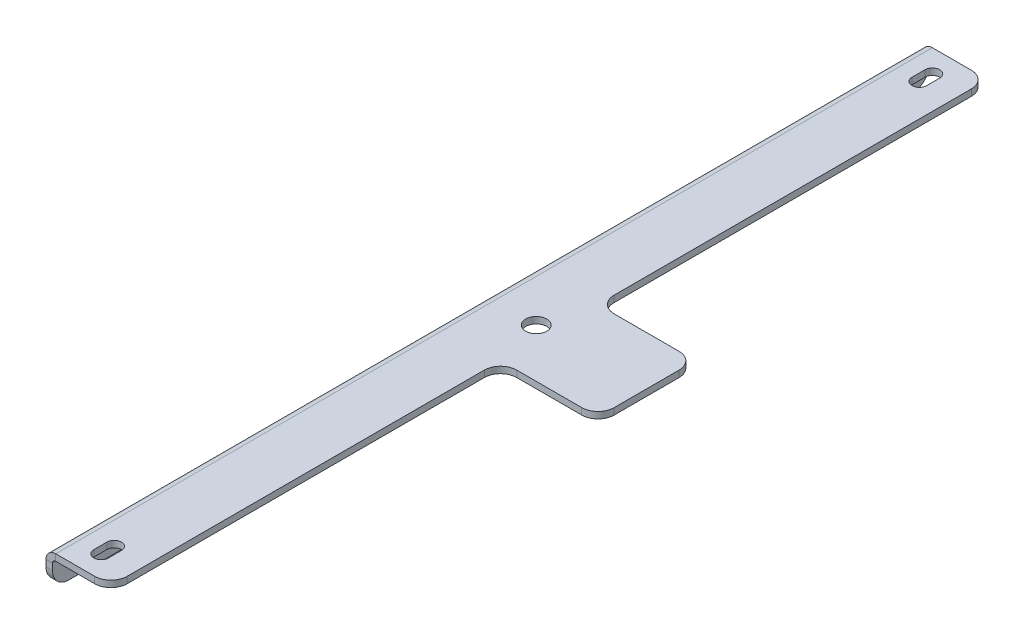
ISO-10303-21;
HEADER;
FILE_DESCRIPTION(('STEP AP214'),'2;1');
FILE_NAME('part.step','',(''),(''),'','','');
FILE_SCHEMA(('AUTOMOTIVE_DESIGN { 1 0 10303 214 1 1 1 1 }'));
ENDSEC;
DATA;
#1=APPLICATION_CONTEXT('core data for automotive mechanical design processes');
#2=APPLICATION_PROTOCOL_DEFINITION('international standard','automotive_design',2000,#1);
#3=PRODUCT_CONTEXT('',#1,'mechanical');
#4=PRODUCT('Part','Part','',(#3));
#5=PRODUCT_RELATED_PRODUCT_CATEGORY('part','',(#4));
#6=PRODUCT_DEFINITION_FORMATION('','',#4);
#7=PRODUCT_DEFINITION_CONTEXT('part definition',#1,'design');
#8=PRODUCT_DEFINITION('design','',#6,#7);
#9=PRODUCT_DEFINITION_SHAPE('','',#8);
#10=(LENGTH_UNIT() NAMED_UNIT(*) SI_UNIT(.MILLI.,.METRE.));
#11=(NAMED_UNIT(*) PLANE_ANGLE_UNIT() SI_UNIT($,.RADIAN.));
#12=(NAMED_UNIT(*) SI_UNIT($,.STERADIAN.) SOLID_ANGLE_UNIT());
#13=UNCERTAINTY_MEASURE_WITH_UNIT(LENGTH_MEASURE(1.E-05),#10,'distance_accuracy_value','');
#14=(GEOMETRIC_REPRESENTATION_CONTEXT(3) GLOBAL_UNCERTAINTY_ASSIGNED_CONTEXT((#13)) GLOBAL_UNIT_ASSIGNED_CONTEXT((#10,
#11,#12)) REPRESENTATION_CONTEXT('',''));
#15=CARTESIAN_POINT('',(0.,0.,0.));
#16=DIRECTION('',(0.,0.,1.));
#17=DIRECTION('',(1.,0.,0.));
#18=AXIS2_PLACEMENT_3D('',#15,#16,#17);
#19=CARTESIAN_POINT('',(0.,-2.,-270.));
#20=DIRECTION('',(0.,0.,-1.));
#21=DIRECTION('',(-1.,0.,0.));
#22=AXIS2_PLACEMENT_3D('',#19,#20,#21);
#23=PLANE('',#22);
#24=DIRECTION('',(-1.,0.,0.));
#25=VECTOR('',#24,1.);
#26=CARTESIAN_POINT('',(0.,0.,-270.));
#27=LINE('',#26,#25);
#28=CARTESIAN_POINT('',(15.,0.,-270.));
#29=VERTEX_POINT('',#28);
#30=CARTESIAN_POINT('',(3.,0.,-270.));
#31=VERTEX_POINT('',#30);
#32=EDGE_CURVE('E379',#29,#31,#27,.T.);
#33=ORIENTED_EDGE('',*,*,#32,.F.);
#34=DIRECTION('',(0.,1.,0.));
#35=VECTOR('',#34,1.);
#36=CARTESIAN_POINT('',(15.,-2.,-270.));
#37=LINE('',#36,#35);
#38=CARTESIAN_POINT('',(15.,-2.,-270.));
#39=VERTEX_POINT('',#38);
#40=EDGE_CURVE('E440',#29,#39,#37,.F.);
#41=ORIENTED_EDGE('',*,*,#40,.T.);
#42=DIRECTION('',(-1.,0.,0.));
#43=VECTOR('',#42,1.);
#44=CARTESIAN_POINT('',(0.,-2.,-270.));
#45=LINE('',#44,#43);
#46=CARTESIAN_POINT('',(3.,-2.,-270.));
#47=VERTEX_POINT('',#46);
#48=EDGE_CURVE('E393',#39,#47,#45,.T.);
#49=ORIENTED_EDGE('',*,*,#48,.T.);
#50=DIRECTION('',(0.,1.,0.));
#51=VECTOR('',#50,1.);
#52=CARTESIAN_POINT('',(3.,-2.,-270.));
#53=LINE('',#52,#51);
#54=EDGE_CURVE('E291',#47,#31,#53,.T.);
#55=ORIENTED_EDGE('',*,*,#54,.T.);
#56=EDGE_LOOP('',(#33,#41,#49,#55));
#57=FACE_BOUND('',#56,.T.);
#58=ADVANCED_FACE('F56',(#57),#23,.T.);
#59=CARTESIAN_POINT('',(0.,-2.,0.));
#60=DIRECTION('',(0.,-1.,0.));
#61=DIRECTION('',(0.,0.,-1.));
#62=AXIS2_PLACEMENT_3D('',#59,#60,#61);
#63=PLANE('',#62);
#64=CARTESIAN_POINT('',(16.,-2.,-135.));
#65=DIRECTION('',(0.,1.,0.));
#66=DIRECTION('',(0.,0.,1.));
#67=AXIS2_PLACEMENT_3D('',#64,#65,#66);
#68=CIRCLE('',#67,3.25000000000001);
#69=CARTESIAN_POINT('',(16.,-2.,-131.75));
#70=VERTEX_POINT('',#69);
#71=EDGE_CURVE('E305',#70,#70,#68,.T.);
#72=ORIENTED_EDGE('',*,*,#71,.T.);
#73=EDGE_LOOP('',(#72));
#74=FACE_BOUND('',#73,.T.);
#75=CARTESIAN_POINT('',(10.,-2.,-11.));
#76=DIRECTION('',(0.,1.,0.));
#77=DIRECTION('',(0.,0.,1.));
#78=AXIS2_PLACEMENT_3D('',#75,#76,#77);
#79=CIRCLE('',#78,2.25);
#80=CARTESIAN_POINT('',(12.25,-2.,-11.));
#81=VERTEX_POINT('',#80);
#82=CARTESIAN_POINT('',(7.75,-2.,-11.));
#83=VERTEX_POINT('',#82);
#84=EDGE_CURVE('E311',#81,#83,#79,.T.);
#85=ORIENTED_EDGE('',*,*,#84,.T.);
#86=DIRECTION('',(0.,0.,1.));
#87=VECTOR('',#86,1.);
#88=CARTESIAN_POINT('',(7.75,-2.,-11.));
#89=LINE('',#88,#87);
#90=CARTESIAN_POINT('',(7.75,-2.,-7.00000000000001));
#91=VERTEX_POINT('',#90);
#92=EDGE_CURVE('E314',#83,#91,#89,.T.);
#93=ORIENTED_EDGE('',*,*,#92,.T.);
#94=CARTESIAN_POINT('',(10.,-2.,-7.00000000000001));
#95=DIRECTION('',(0.,1.,0.));
#96=DIRECTION('',(0.,0.,1.));
#97=AXIS2_PLACEMENT_3D('',#94,#95,#96);
#98=CIRCLE('',#97,2.25);
#99=CARTESIAN_POINT('',(12.25,-2.,-7.00000000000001));
#100=VERTEX_POINT('',#99);
#101=EDGE_CURVE('E318',#91,#100,#98,.T.);
#102=ORIENTED_EDGE('',*,*,#101,.T.);
#103=DIRECTION('',(0.,0.,-1.));
#104=VECTOR('',#103,1.);
#105=CARTESIAN_POINT('',(12.25,-2.,-11.));
#106=LINE('',#105,#104);
#107=EDGE_CURVE('E321',#100,#81,#106,.T.);
#108=ORIENTED_EDGE('',*,*,#107,.T.);
#109=EDGE_LOOP('',(#85,#93,#102,#108));
#110=FACE_BOUND('',#109,.T.);
#111=CARTESIAN_POINT('',(9.99999999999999,-2.,-263.));
#112=DIRECTION('',(0.,1.,0.));
#113=DIRECTION('',(0.,0.,1.));
#114=AXIS2_PLACEMENT_3D('',#111,#112,#113);
#115=CIRCLE('',#114,2.24999999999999);
#116=CARTESIAN_POINT('',(12.25,-2.,-263.));
#117=VERTEX_POINT('',#116);
#118=CARTESIAN_POINT('',(7.75000000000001,-2.,-263.));
#119=VERTEX_POINT('',#118);
#120=EDGE_CURVE('E343',#117,#119,#115,.T.);
#121=ORIENTED_EDGE('',*,*,#120,.T.);
#122=DIRECTION('',(0.,0.,1.));
#123=VECTOR('',#122,1.);
#124=CARTESIAN_POINT('',(7.75000000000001,-2.,-263.));
#125=LINE('',#124,#123);
#126=CARTESIAN_POINT('',(7.75000000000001,-2.,-259.));
#127=VERTEX_POINT('',#126);
#128=EDGE_CURVE('E346',#119,#127,#125,.T.);
#129=ORIENTED_EDGE('',*,*,#128,.T.);
#130=CARTESIAN_POINT('',(9.99999999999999,-2.,-259.));
#131=DIRECTION('',(0.,1.,0.));
#132=DIRECTION('',(0.,0.,1.));
#133=AXIS2_PLACEMENT_3D('',#130,#131,#132);
#134=CIRCLE('',#133,2.24999999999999);
#135=CARTESIAN_POINT('',(12.25,-2.,-259.));
#136=VERTEX_POINT('',#135);
#137=EDGE_CURVE('E350',#127,#136,#134,.T.);
#138=ORIENTED_EDGE('',*,*,#137,.T.);
#139=DIRECTION('',(0.,0.,-1.));
#140=VECTOR('',#139,1.);
#141=CARTESIAN_POINT('',(12.25,-2.,-263.));
#142=LINE('',#141,#140);
#143=EDGE_CURVE('E353',#136,#117,#142,.T.);
#144=ORIENTED_EDGE('',*,*,#143,.T.);
#145=EDGE_LOOP('',(#121,#129,#138,#144));
#146=FACE_BOUND('',#145,.T.);
#147=ORIENTED_EDGE('',*,*,#48,.F.);
#148=CARTESIAN_POINT('',(15.,-2.,-265.));
#149=DIRECTION('',(0.,-1.,0.));
#150=DIRECTION('',(0.,0.,-1.));
#151=AXIS2_PLACEMENT_3D('',#148,#149,#150);
#152=CIRCLE('',#151,5.);
#153=CARTESIAN_POINT('',(20.,-2.,-265.));
#154=VERTEX_POINT('',#153);
#155=EDGE_CURVE('E448',#39,#154,#152,.T.);
#156=ORIENTED_EDGE('',*,*,#155,.T.);
#157=DIRECTION('',(0.,0.,-1.));
#158=VECTOR('',#157,1.);
#159=CARTESIAN_POINT('',(20.,-2.,-150.));
#160=LINE('',#159,#158);
#161=CARTESIAN_POINT('',(20.,-2.,-155.));
#162=VERTEX_POINT('',#161);
#163=EDGE_CURVE('E390',#162,#154,#160,.T.);
#164=ORIENTED_EDGE('',*,*,#163,.F.);
#165=CARTESIAN_POINT('',(25.,-2.,-155.));
#166=DIRECTION('',(0.,-1.,0.));
#167=DIRECTION('',(0.,0.,-1.));
#168=AXIS2_PLACEMENT_3D('',#165,#166,#167);
#169=CIRCLE('',#168,5.);
#170=CARTESIAN_POINT('',(25.,-2.,-150.));
#171=VERTEX_POINT('',#170);
#172=EDGE_CURVE('E477',#162,#171,#169,.F.);
#173=ORIENTED_EDGE('',*,*,#172,.T.);
#174=DIRECTION('',(-1.,0.,0.));
#175=VECTOR('',#174,1.);
#176=CARTESIAN_POINT('',(20.,-2.,-150.));
#177=LINE('',#176,#175);
#178=CARTESIAN_POINT('',(45.,-2.,-150.));
#179=VERTEX_POINT('',#178);
#180=EDGE_CURVE('E387',#179,#171,#177,.T.);
#181=ORIENTED_EDGE('',*,*,#180,.F.);
#182=CARTESIAN_POINT('',(45.,-2.,-145.));
#183=DIRECTION('',(0.,-1.,0.));
#184=DIRECTION('',(0.,0.,-1.));
#185=AXIS2_PLACEMENT_3D('',#182,#183,#184);
#186=CIRCLE('',#185,5.);
#187=CARTESIAN_POINT('',(50.,-2.,-145.));
#188=VERTEX_POINT('',#187);
#189=EDGE_CURVE('E446',#179,#188,#186,.T.);
#190=ORIENTED_EDGE('',*,*,#189,.T.);
#191=DIRECTION('',(0.,0.,-1.));
#192=VECTOR('',#191,1.);
#193=CARTESIAN_POINT('',(50.,-2.,-150.));
#194=LINE('',#193,#192);
#195=CARTESIAN_POINT('',(50.,-2.,-125.));
#196=VERTEX_POINT('',#195);
#197=EDGE_CURVE('E384',#196,#188,#194,.T.);
#198=ORIENTED_EDGE('',*,*,#197,.F.);
#199=CARTESIAN_POINT('',(45.,-2.,-125.));
#200=DIRECTION('',(0.,-1.,0.));
#201=DIRECTION('',(0.,0.,-1.));
#202=AXIS2_PLACEMENT_3D('',#199,#200,#201);
#203=CIRCLE('',#202,5.);
#204=CARTESIAN_POINT('',(45.,-2.,-120.));
#205=VERTEX_POINT('',#204);
#206=EDGE_CURVE('E444',#196,#205,#203,.T.);
#207=ORIENTED_EDGE('',*,*,#206,.T.);
#208=DIRECTION('',(1.,0.,0.));
#209=VECTOR('',#208,1.);
#210=CARTESIAN_POINT('',(20.,-2.,-120.));
#211=LINE('',#210,#209);
#212=CARTESIAN_POINT('',(25.,-2.,-120.));
#213=VERTEX_POINT('',#212);
#214=EDGE_CURVE('E381',#213,#205,#211,.T.);
#215=ORIENTED_EDGE('',*,*,#214,.F.);
#216=CARTESIAN_POINT('',(25.,-2.,-115.));
#217=DIRECTION('',(0.,-1.,0.));
#218=DIRECTION('',(0.,0.,-1.));
#219=AXIS2_PLACEMENT_3D('',#216,#217,#218);
#220=CIRCLE('',#219,5.);
#221=CARTESIAN_POINT('',(20.,-2.,-115.));
#222=VERTEX_POINT('',#221);
#223=EDGE_CURVE('E13',#213,#222,#220,.F.);
#224=ORIENTED_EDGE('',*,*,#223,.T.);
#225=DIRECTION('',(0.,0.,-1.));
#226=VECTOR('',#225,1.);
#227=CARTESIAN_POINT('',(20.,-2.,0.));
#228=LINE('',#227,#226);
#229=CARTESIAN_POINT('',(20.,-2.,-5.));
#230=VERTEX_POINT('',#229);
#231=EDGE_CURVE('E378',#230,#222,#228,.T.);
#232=ORIENTED_EDGE('',*,*,#231,.F.);
#233=CARTESIAN_POINT('',(15.,-2.,-5.));
#234=DIRECTION('',(0.,-1.,0.));
#235=DIRECTION('',(0.,0.,-1.));
#236=AXIS2_PLACEMENT_3D('',#233,#234,#235);
#237=CIRCLE('',#236,5.);
#238=CARTESIAN_POINT('',(15.,-2.,0.));
#239=VERTEX_POINT('',#238);
#240=EDGE_CURVE('E442',#230,#239,#237,.T.);
#241=ORIENTED_EDGE('',*,*,#240,.T.);
#242=DIRECTION('',(1.,0.,0.));
#243=VECTOR('',#242,1.);
#244=CARTESIAN_POINT('',(0.,-2.,0.));
#245=LINE('',#244,#243);
#246=CARTESIAN_POINT('',(3.,-2.,0.));
#247=VERTEX_POINT('',#246);
#248=EDGE_CURVE('E375',#247,#239,#245,.T.);
#249=ORIENTED_EDGE('',*,*,#248,.F.);
#250=DIRECTION('',(0.,0.,-1.));
#251=VECTOR('',#250,1.);
#252=CARTESIAN_POINT('',(3.,-2.,-270.));
#253=LINE('',#252,#251);
#254=EDGE_CURVE('E295',#47,#247,#253,.F.);
#255=ORIENTED_EDGE('',*,*,#254,.F.);
#256=EDGE_LOOP('',(#147,#156,#164,#173,#181,#190,#198,#207,#215,#224,#232,#241,#249,#255));
#257=FACE_BOUND('',#256,.T.);
#258=ADVANCED_FACE('F491',(#74,#110,#146,#257),#63,.T.);
#259=CARTESIAN_POINT('',(0.,0.,0.));
#260=DIRECTION('',(0.,-1.,0.));
#261=DIRECTION('',(0.,0.,-1.));
#262=AXIS2_PLACEMENT_3D('',#259,#260,#261);
#263=PLANE('',#262);
#264=DIRECTION('',(0.,0.,1.));
#265=VECTOR('',#264,1.);
#266=CARTESIAN_POINT('',(7.75000000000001,0.,-263.));
#267=LINE('',#266,#265);
#268=CARTESIAN_POINT('',(7.75000000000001,0.,-263.));
#269=VERTEX_POINT('',#268);
#270=CARTESIAN_POINT('',(7.75,0.,-259.));
#271=VERTEX_POINT('',#270);
#272=EDGE_CURVE('E358',#269,#271,#267,.T.);
#273=ORIENTED_EDGE('',*,*,#272,.F.);
#274=CARTESIAN_POINT('',(9.99999999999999,0.,-263.));
#275=DIRECTION('',(0.,1.,0.));
#276=DIRECTION('',(0.,0.,1.));
#277=AXIS2_PLACEMENT_3D('',#274,#275,#276);
#278=CIRCLE('',#277,2.24999999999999);
#279=CARTESIAN_POINT('',(12.25,0.,-263.));
#280=VERTEX_POINT('',#279);
#281=EDGE_CURVE('E336',#280,#269,#278,.T.);
#282=ORIENTED_EDGE('',*,*,#281,.F.);
#283=DIRECTION('',(0.,0.,-1.));
#284=VECTOR('',#283,1.);
#285=CARTESIAN_POINT('',(12.25,0.,-263.));
#286=LINE('',#285,#284);
#287=CARTESIAN_POINT('',(12.25,0.,-259.));
#288=VERTEX_POINT('',#287);
#289=EDGE_CURVE('E347',#288,#280,#286,.T.);
#290=ORIENTED_EDGE('',*,*,#289,.F.);
#291=CARTESIAN_POINT('',(9.99999999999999,0.,-259.));
#292=DIRECTION('',(0.,1.,0.));
#293=DIRECTION('',(0.,0.,1.));
#294=AXIS2_PLACEMENT_3D('',#291,#292,#293);
#295=CIRCLE('',#294,2.24999999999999);
#296=EDGE_CURVE('E361',#271,#288,#295,.T.);
#297=ORIENTED_EDGE('',*,*,#296,.F.);
#298=EDGE_LOOP('',(#273,#282,#290,#297));
#299=FACE_BOUND('',#298,.T.);
#300=DIRECTION('',(0.,0.,1.));
#301=VECTOR('',#300,1.);
#302=CARTESIAN_POINT('',(7.75,0.,-11.));
#303=LINE('',#302,#301);
#304=CARTESIAN_POINT('',(7.75,0.,-11.));
#305=VERTEX_POINT('',#304);
#306=CARTESIAN_POINT('',(7.75,0.,-7.00000000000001));
#307=VERTEX_POINT('',#306);
#308=EDGE_CURVE('E326',#305,#307,#303,.T.);
#309=ORIENTED_EDGE('',*,*,#308,.F.);
#310=CARTESIAN_POINT('',(10.,0.,-11.));
#311=DIRECTION('',(0.,1.,0.));
#312=DIRECTION('',(0.,0.,1.));
#313=AXIS2_PLACEMENT_3D('',#310,#311,#312);
#314=CIRCLE('',#313,2.25);
#315=CARTESIAN_POINT('',(12.25,0.,-11.));
#316=VERTEX_POINT('',#315);
#317=EDGE_CURVE('E308',#316,#305,#314,.T.);
#318=ORIENTED_EDGE('',*,*,#317,.F.);
#319=DIRECTION('',(0.,0.,-1.));
#320=VECTOR('',#319,1.);
#321=CARTESIAN_POINT('',(12.25,0.,-11.));
#322=LINE('',#321,#320);
#323=CARTESIAN_POINT('',(12.25,0.,-7.00000000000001));
#324=VERTEX_POINT('',#323);
#325=EDGE_CURVE('E315',#324,#316,#322,.T.);
#326=ORIENTED_EDGE('',*,*,#325,.F.);
#327=CARTESIAN_POINT('',(10.,0.,-7.00000000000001));
#328=DIRECTION('',(0.,1.,0.));
#329=DIRECTION('',(0.,0.,1.));
#330=AXIS2_PLACEMENT_3D('',#327,#328,#329);
#331=CIRCLE('',#330,2.25);
#332=EDGE_CURVE('E329',#307,#324,#331,.T.);
#333=ORIENTED_EDGE('',*,*,#332,.F.);
#334=EDGE_LOOP('',(#309,#318,#326,#333));
#335=FACE_BOUND('',#334,.T.);
#336=CARTESIAN_POINT('',(16.,0.,-135.));
#337=DIRECTION('',(0.,1.,0.));
#338=DIRECTION('',(0.,0.,1.));
#339=AXIS2_PLACEMENT_3D('',#336,#337,#338);
#340=CIRCLE('',#339,3.25000000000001);
#341=CARTESIAN_POINT('',(16.,0.,-131.75));
#342=VERTEX_POINT('',#341);
#343=EDGE_CURVE('E302',#342,#342,#340,.T.);
#344=ORIENTED_EDGE('',*,*,#343,.F.);
#345=EDGE_LOOP('',(#344));
#346=FACE_BOUND('',#345,.T.);
#347=DIRECTION('',(0.,0.,-1.));
#348=VECTOR('',#347,1.);
#349=CARTESIAN_POINT('',(20.,0.,-150.));
#350=LINE('',#349,#348);
#351=CARTESIAN_POINT('',(20.,0.,-155.));
#352=VERTEX_POINT('',#351);
#353=CARTESIAN_POINT('',(20.,0.,-265.));
#354=VERTEX_POINT('',#353);
#355=EDGE_CURVE('E410',#352,#354,#350,.T.);
#356=ORIENTED_EDGE('',*,*,#355,.T.);
#357=CARTESIAN_POINT('',(15.,0.,-265.));
#358=DIRECTION('',(0.,-1.,0.));
#359=DIRECTION('',(0.,0.,-1.));
#360=AXIS2_PLACEMENT_3D('',#357,#358,#359);
#361=CIRCLE('',#360,5.);
#362=EDGE_CURVE('E438',#354,#29,#361,.F.);
#363=ORIENTED_EDGE('',*,*,#362,.T.);
#364=ORIENTED_EDGE('',*,*,#32,.T.);
#365=DIRECTION('',(0.,0.,-1.));
#366=VECTOR('',#365,1.);
#367=CARTESIAN_POINT('',(3.,0.,-270.));
#368=LINE('',#367,#366);
#369=CARTESIAN_POINT('',(3.,0.,0.));
#370=VERTEX_POINT('',#369);
#371=EDGE_CURVE('E263',#31,#370,#368,.F.);
#372=ORIENTED_EDGE('',*,*,#371,.T.);
#373=DIRECTION('',(1.,0.,0.));
#374=VECTOR('',#373,1.);
#375=CARTESIAN_POINT('',(0.,0.,0.));
#376=LINE('',#375,#374);
#377=CARTESIAN_POINT('',(15.,0.,0.));
#378=VERTEX_POINT('',#377);
#379=EDGE_CURVE('E368',#370,#378,#376,.T.);
#380=ORIENTED_EDGE('',*,*,#379,.T.);
#381=CARTESIAN_POINT('',(15.,0.,-5.));
#382=DIRECTION('',(0.,-1.,0.));
#383=DIRECTION('',(0.,0.,-1.));
#384=AXIS2_PLACEMENT_3D('',#381,#382,#383);
#385=CIRCLE('',#384,5.);
#386=CARTESIAN_POINT('',(20.,0.,-5.));
#387=VERTEX_POINT('',#386);
#388=EDGE_CURVE('E432',#378,#387,#385,.F.);
#389=ORIENTED_EDGE('',*,*,#388,.T.);
#390=DIRECTION('',(0.,0.,-1.));
#391=VECTOR('',#390,1.);
#392=CARTESIAN_POINT('',(20.,0.,0.));
#393=LINE('',#392,#391);
#394=CARTESIAN_POINT('',(20.,0.,-115.));
#395=VERTEX_POINT('',#394);
#396=EDGE_CURVE('E398',#387,#395,#393,.T.);
#397=ORIENTED_EDGE('',*,*,#396,.T.);
#398=CARTESIAN_POINT('',(25.,0.,-115.));
#399=DIRECTION('',(0.,-1.,0.));
#400=DIRECTION('',(0.,0.,-1.));
#401=AXIS2_PLACEMENT_3D('',#398,#399,#400);
#402=CIRCLE('',#401,5.);
#403=CARTESIAN_POINT('',(25.,0.,-120.));
#404=VERTEX_POINT('',#403);
#405=EDGE_CURVE('E64',#395,#404,#402,.T.);
#406=ORIENTED_EDGE('',*,*,#405,.T.);
#407=DIRECTION('',(1.,0.,0.));
#408=VECTOR('',#407,1.);
#409=CARTESIAN_POINT('',(20.,0.,-120.));
#410=LINE('',#409,#408);
#411=CARTESIAN_POINT('',(45.,0.,-120.));
#412=VERTEX_POINT('',#411);
#413=EDGE_CURVE('E401',#404,#412,#410,.T.);
#414=ORIENTED_EDGE('',*,*,#413,.T.);
#415=CARTESIAN_POINT('',(45.,0.,-125.));
#416=DIRECTION('',(0.,-1.,0.));
#417=DIRECTION('',(0.,0.,-1.));
#418=AXIS2_PLACEMENT_3D('',#415,#416,#417);
#419=CIRCLE('',#418,5.);
#420=CARTESIAN_POINT('',(50.,0.,-125.));
#421=VERTEX_POINT('',#420);
#422=EDGE_CURVE('E434',#412,#421,#419,.F.);
#423=ORIENTED_EDGE('',*,*,#422,.T.);
#424=DIRECTION('',(0.,0.,-1.));
#425=VECTOR('',#424,1.);
#426=CARTESIAN_POINT('',(50.,0.,-150.));
#427=LINE('',#426,#425);
#428=CARTESIAN_POINT('',(50.,0.,-145.));
#429=VERTEX_POINT('',#428);
#430=EDGE_CURVE('E404',#421,#429,#427,.T.);
#431=ORIENTED_EDGE('',*,*,#430,.T.);
#432=CARTESIAN_POINT('',(45.,0.,-145.));
#433=DIRECTION('',(0.,-1.,0.));
#434=DIRECTION('',(0.,0.,-1.));
#435=AXIS2_PLACEMENT_3D('',#432,#433,#434);
#436=CIRCLE('',#435,5.);
#437=CARTESIAN_POINT('',(45.,0.,-150.));
#438=VERTEX_POINT('',#437);
#439=EDGE_CURVE('E436',#429,#438,#436,.F.);
#440=ORIENTED_EDGE('',*,*,#439,.T.);
#441=DIRECTION('',(-1.,0.,0.));
#442=VECTOR('',#441,1.);
#443=CARTESIAN_POINT('',(20.,0.,-150.));
#444=LINE('',#443,#442);
#445=CARTESIAN_POINT('',(25.,0.,-150.));
#446=VERTEX_POINT('',#445);
#447=EDGE_CURVE('E407',#438,#446,#444,.T.);
#448=ORIENTED_EDGE('',*,*,#447,.T.);
#449=CARTESIAN_POINT('',(25.,0.,-155.));
#450=DIRECTION('',(0.,-1.,0.));
#451=DIRECTION('',(0.,0.,-1.));
#452=AXIS2_PLACEMENT_3D('',#449,#450,#451);
#453=CIRCLE('',#452,5.);
#454=EDGE_CURVE('E475',#446,#352,#453,.T.);
#455=ORIENTED_EDGE('',*,*,#454,.T.);
#456=EDGE_LOOP('',(#356,#363,#364,#372,#380,#389,#397,#406,#414,#423,#431,#440,#448,#455));
#457=FACE_BOUND('',#456,.T.);
#458=ADVANCED_FACE('F480',(#299,#335,#346,#457),#263,.F.);
#459=CARTESIAN_POINT('',(20.,-2.,-150.));
#460=DIRECTION('',(1.,0.,0.));
#461=DIRECTION('',(0.,0.,-1.));
#462=AXIS2_PLACEMENT_3D('',#459,#460,#461);
#463=PLANE('',#462);
#464=ORIENTED_EDGE('',*,*,#163,.T.);
#465=DIRECTION('',(0.,1.,0.));
#466=VECTOR('',#465,1.);
#467=CARTESIAN_POINT('',(20.,-2.,-265.));
#468=LINE('',#467,#466);
#469=EDGE_CURVE('E429',#154,#354,#468,.T.);
#470=ORIENTED_EDGE('',*,*,#469,.T.);
#471=ORIENTED_EDGE('',*,*,#355,.F.);
#472=DIRECTION('',(0.,1.,0.));
#473=VECTOR('',#472,1.);
#474=CARTESIAN_POINT('',(20.,-2.,-155.));
#475=LINE('',#474,#473);
#476=EDGE_CURVE('E427',#352,#162,#475,.F.);
#477=ORIENTED_EDGE('',*,*,#476,.T.);
#478=EDGE_LOOP('',(#464,#470,#471,#477));
#479=FACE_BOUND('',#478,.T.);
#480=ADVANCED_FACE('F550',(#479),#463,.T.);
#481=CARTESIAN_POINT('',(20.,-2.,-150.));
#482=DIRECTION('',(0.,0.,-1.));
#483=DIRECTION('',(-1.,0.,0.));
#484=AXIS2_PLACEMENT_3D('',#481,#482,#483);
#485=PLANE('',#484);
#486=ORIENTED_EDGE('',*,*,#180,.T.);
#487=DIRECTION('',(0.,1.,0.));
#488=VECTOR('',#487,1.);
#489=CARTESIAN_POINT('',(25.,0.,-150.));
#490=LINE('',#489,#488);
#491=EDGE_CURVE('E452',#171,#446,#490,.T.);
#492=ORIENTED_EDGE('',*,*,#491,.T.);
#493=ORIENTED_EDGE('',*,*,#447,.F.);
#494=DIRECTION('',(0.,1.,0.));
#495=VECTOR('',#494,1.);
#496=CARTESIAN_POINT('',(45.,-2.,-150.));
#497=LINE('',#496,#495);
#498=EDGE_CURVE('E450',#438,#179,#497,.F.);
#499=ORIENTED_EDGE('',*,*,#498,.T.);
#500=EDGE_LOOP('',(#486,#492,#493,#499));
#501=FACE_BOUND('',#500,.T.);
#502=ADVANCED_FACE('F553',(#501),#485,.T.);
#503=CARTESIAN_POINT('',(50.,-2.,-150.));
#504=DIRECTION('',(1.,0.,0.));
#505=DIRECTION('',(0.,0.,-1.));
#506=AXIS2_PLACEMENT_3D('',#503,#504,#505);
#507=PLANE('',#506);
#508=ORIENTED_EDGE('',*,*,#197,.T.);
#509=DIRECTION('',(0.,1.,0.));
#510=VECTOR('',#509,1.);
#511=CARTESIAN_POINT('',(50.,-2.,-145.));
#512=LINE('',#511,#510);
#513=EDGE_CURVE('E457',#188,#429,#512,.T.);
#514=ORIENTED_EDGE('',*,*,#513,.T.);
#515=ORIENTED_EDGE('',*,*,#430,.F.);
#516=DIRECTION('',(0.,1.,0.));
#517=VECTOR('',#516,1.);
#518=CARTESIAN_POINT('',(50.,-2.,-125.));
#519=LINE('',#518,#517);
#520=EDGE_CURVE('E455',#421,#196,#519,.F.);
#521=ORIENTED_EDGE('',*,*,#520,.T.);
#522=EDGE_LOOP('',(#508,#514,#515,#521));
#523=FACE_BOUND('',#522,.T.);
#524=ADVANCED_FACE('F557',(#523),#507,.T.);
#525=CARTESIAN_POINT('',(20.,-2.,-120.));
#526=DIRECTION('',(0.,0.,1.));
#527=DIRECTION('',(1.,0.,0.));
#528=AXIS2_PLACEMENT_3D('',#525,#526,#527);
#529=PLANE('',#528);
#530=ORIENTED_EDGE('',*,*,#214,.T.);
#531=DIRECTION('',(0.,1.,0.));
#532=VECTOR('',#531,1.);
#533=CARTESIAN_POINT('',(45.,-2.,-120.));
#534=LINE('',#533,#532);
#535=EDGE_CURVE('E462',#205,#412,#534,.T.);
#536=ORIENTED_EDGE('',*,*,#535,.T.);
#537=ORIENTED_EDGE('',*,*,#413,.F.);
#538=DIRECTION('',(0.,1.,0.));
#539=VECTOR('',#538,1.);
#540=CARTESIAN_POINT('',(25.,-2.,-120.));
#541=LINE('',#540,#539);
#542=EDGE_CURVE('E460',#404,#213,#541,.F.);
#543=ORIENTED_EDGE('',*,*,#542,.T.);
#544=EDGE_LOOP('',(#530,#536,#537,#543));
#545=FACE_BOUND('',#544,.T.);
#546=ADVANCED_FACE('F485',(#545),#529,.T.);
#547=CARTESIAN_POINT('',(20.,-2.,0.));
#548=DIRECTION('',(1.,0.,0.));
#549=DIRECTION('',(0.,0.,-1.));
#550=AXIS2_PLACEMENT_3D('',#547,#548,#549);
#551=PLANE('',#550);
#552=ORIENTED_EDGE('',*,*,#231,.T.);
#553=DIRECTION('',(0.,1.,0.));
#554=VECTOR('',#553,1.);
#555=CARTESIAN_POINT('',(20.,0.,-115.));
#556=LINE('',#555,#554);
#557=EDGE_CURVE('E466',#222,#395,#556,.T.);
#558=ORIENTED_EDGE('',*,*,#557,.T.);
#559=ORIENTED_EDGE('',*,*,#396,.F.);
#560=DIRECTION('',(0.,1.,0.));
#561=VECTOR('',#560,1.);
#562=CARTESIAN_POINT('',(20.,-2.,-5.));
#563=LINE('',#562,#561);
#564=EDGE_CURVE('E76',#387,#230,#563,.F.);
#565=ORIENTED_EDGE('',*,*,#564,.T.);
#566=EDGE_LOOP('',(#552,#558,#559,#565));
#567=FACE_BOUND('',#566,.T.);
#568=ADVANCED_FACE('F488',(#567),#551,.T.);
#569=CARTESIAN_POINT('',(0.,-2.,0.));
#570=DIRECTION('',(0.,0.,1.));
#571=DIRECTION('',(1.,0.,0.));
#572=AXIS2_PLACEMENT_3D('',#569,#570,#571);
#573=PLANE('',#572);
#574=ORIENTED_EDGE('',*,*,#248,.T.);
#575=DIRECTION('',(0.,1.,0.));
#576=VECTOR('',#575,1.);
#577=CARTESIAN_POINT('',(15.,-2.,0.));
#578=LINE('',#577,#576);
#579=EDGE_CURVE('E469',#239,#378,#578,.T.);
#580=ORIENTED_EDGE('',*,*,#579,.T.);
#581=ORIENTED_EDGE('',*,*,#379,.F.);
#582=DIRECTION('',(0.,1.,0.));
#583=VECTOR('',#582,1.);
#584=CARTESIAN_POINT('',(3.,-2.,0.));
#585=LINE('',#584,#583);
#586=EDGE_CURVE('E299',#247,#370,#585,.T.);
#587=ORIENTED_EDGE('',*,*,#586,.F.);
#588=EDGE_LOOP('',(#574,#580,#581,#587));
#589=FACE_BOUND('',#588,.T.);
#590=ADVANCED_FACE('F498',(#589),#573,.T.);
#591=CARTESIAN_POINT('',(9.99999999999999,-2.,-263.));
#592=DIRECTION('',(0.,1.,0.));
#593=DIRECTION('',(0.,0.,1.));
#594=AXIS2_PLACEMENT_3D('',#591,#592,#593);
#595=CYLINDRICAL_SURFACE('',#594,2.24999999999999);
#596=ORIENTED_EDGE('',*,*,#281,.T.);
#597=DIRECTION('',(0.,1.,0.));
#598=VECTOR('',#597,1.);
#599=CARTESIAN_POINT('',(7.75000000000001,-2.,-263.));
#600=LINE('',#599,#598);
#601=EDGE_CURVE('E356',#119,#269,#600,.T.);
#602=ORIENTED_EDGE('',*,*,#601,.F.);
#603=ORIENTED_EDGE('',*,*,#120,.F.);
#604=DIRECTION('',(0.,1.,0.));
#605=VECTOR('',#604,1.);
#606=CARTESIAN_POINT('',(12.25,-2.,-263.));
#607=LINE('',#606,#605);
#608=EDGE_CURVE('E366',#117,#280,#607,.T.);
#609=ORIENTED_EDGE('',*,*,#608,.T.);
#610=EDGE_LOOP('',(#596,#602,#603,#609));
#611=FACE_BOUND('',#610,.T.);
#612=ADVANCED_FACE('F566',(#611),#595,.F.);
#613=CARTESIAN_POINT('',(12.25,-2.,-263.));
#614=DIRECTION('',(1.,0.,0.));
#615=DIRECTION('',(0.,0.,-1.));
#616=AXIS2_PLACEMENT_3D('',#613,#614,#615);
#617=PLANE('',#616);
#618=ORIENTED_EDGE('',*,*,#289,.T.);
#619=ORIENTED_EDGE('',*,*,#608,.F.);
#620=ORIENTED_EDGE('',*,*,#143,.F.);
#621=DIRECTION('',(0.,1.,0.));
#622=VECTOR('',#621,1.);
#623=CARTESIAN_POINT('',(12.25,-2.,-259.));
#624=LINE('',#623,#622);
#625=EDGE_CURVE('E369',#136,#288,#624,.T.);
#626=ORIENTED_EDGE('',*,*,#625,.T.);
#627=EDGE_LOOP('',(#618,#619,#620,#626));
#628=FACE_BOUND('',#627,.T.);
#629=ADVANCED_FACE('F570',(#628),#617,.F.);
#630=CARTESIAN_POINT('',(9.99999999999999,-2.,-259.));
#631=DIRECTION('',(0.,1.,0.));
#632=DIRECTION('',(0.,0.,1.));
#633=AXIS2_PLACEMENT_3D('',#630,#631,#632);
#634=CYLINDRICAL_SURFACE('',#633,2.24999999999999);
#635=ORIENTED_EDGE('',*,*,#296,.T.);
#636=ORIENTED_EDGE('',*,*,#625,.F.);
#637=ORIENTED_EDGE('',*,*,#137,.F.);
#638=DIRECTION('',(0.,1.,0.));
#639=VECTOR('',#638,1.);
#640=CARTESIAN_POINT('',(7.75,-2.,-259.));
#641=LINE('',#640,#639);
#642=EDGE_CURVE('E371',#127,#271,#641,.T.);
#643=ORIENTED_EDGE('',*,*,#642,.T.);
#644=EDGE_LOOP('',(#635,#636,#637,#643));
#645=FACE_BOUND('',#644,.T.);
#646=ADVANCED_FACE('F576',(#645),#634,.F.);
#647=CARTESIAN_POINT('',(7.75000000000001,-2.,-263.));
#648=DIRECTION('',(-1.,0.,0.));
#649=DIRECTION('',(0.,0.,1.));
#650=AXIS2_PLACEMENT_3D('',#647,#648,#649);
#651=PLANE('',#650);
#652=ORIENTED_EDGE('',*,*,#272,.T.);
#653=ORIENTED_EDGE('',*,*,#642,.F.);
#654=ORIENTED_EDGE('',*,*,#128,.F.);
#655=ORIENTED_EDGE('',*,*,#601,.T.);
#656=EDGE_LOOP('',(#652,#653,#654,#655));
#657=FACE_BOUND('',#656,.T.);
#658=ADVANCED_FACE('F580',(#657),#651,.F.);
#659=CARTESIAN_POINT('',(10.,-2.,-11.));
#660=DIRECTION('',(0.,1.,0.));
#661=DIRECTION('',(0.,0.,1.));
#662=AXIS2_PLACEMENT_3D('',#659,#660,#661);
#663=CYLINDRICAL_SURFACE('',#662,2.25);
#664=ORIENTED_EDGE('',*,*,#317,.T.);
#665=DIRECTION('',(0.,1.,0.));
#666=VECTOR('',#665,1.);
#667=CARTESIAN_POINT('',(7.75,-2.,-11.));
#668=LINE('',#667,#666);
#669=EDGE_CURVE('E324',#83,#305,#668,.T.);
#670=ORIENTED_EDGE('',*,*,#669,.F.);
#671=ORIENTED_EDGE('',*,*,#84,.F.);
#672=DIRECTION('',(0.,1.,0.));
#673=VECTOR('',#672,1.);
#674=CARTESIAN_POINT('',(12.25,-2.,-11.));
#675=LINE('',#674,#673);
#676=EDGE_CURVE('E334',#81,#316,#675,.T.);
#677=ORIENTED_EDGE('',*,*,#676,.T.);
#678=EDGE_LOOP('',(#664,#670,#671,#677));
#679=FACE_BOUND('',#678,.T.);
#680=ADVANCED_FACE('F583',(#679),#663,.F.);
#681=CARTESIAN_POINT('',(12.25,-2.,-11.));
#682=DIRECTION('',(1.,0.,0.));
#683=DIRECTION('',(0.,0.,-1.));
#684=AXIS2_PLACEMENT_3D('',#681,#682,#683);
#685=PLANE('',#684);
#686=ORIENTED_EDGE('',*,*,#325,.T.);
#687=ORIENTED_EDGE('',*,*,#676,.F.);
#688=ORIENTED_EDGE('',*,*,#107,.F.);
#689=DIRECTION('',(0.,1.,0.));
#690=VECTOR('',#689,1.);
#691=CARTESIAN_POINT('',(12.25,-2.,-7.00000000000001));
#692=LINE('',#691,#690);
#693=EDGE_CURVE('E337',#100,#324,#692,.T.);
#694=ORIENTED_EDGE('',*,*,#693,.T.);
#695=EDGE_LOOP('',(#686,#687,#688,#694));
#696=FACE_BOUND('',#695,.T.);
#697=ADVANCED_FACE('F590',(#696),#685,.F.);
#698=CARTESIAN_POINT('',(10.,-2.,-7.00000000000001));
#699=DIRECTION('',(0.,1.,0.));
#700=DIRECTION('',(0.,0.,1.));
#701=AXIS2_PLACEMENT_3D('',#698,#699,#700);
#702=CYLINDRICAL_SURFACE('',#701,2.25);
#703=ORIENTED_EDGE('',*,*,#332,.T.);
#704=ORIENTED_EDGE('',*,*,#693,.F.);
#705=ORIENTED_EDGE('',*,*,#101,.F.);
#706=DIRECTION('',(0.,1.,0.));
#707=VECTOR('',#706,1.);
#708=CARTESIAN_POINT('',(7.75,-2.,-7.00000000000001));
#709=LINE('',#708,#707);
#710=EDGE_CURVE('E339',#91,#307,#709,.T.);
#711=ORIENTED_EDGE('',*,*,#710,.T.);
#712=EDGE_LOOP('',(#703,#704,#705,#711));
#713=FACE_BOUND('',#712,.T.);
#714=ADVANCED_FACE('F596',(#713),#702,.F.);
#715=CARTESIAN_POINT('',(7.75,-2.,-11.));
#716=DIRECTION('',(-1.,0.,0.));
#717=DIRECTION('',(0.,0.,1.));
#718=AXIS2_PLACEMENT_3D('',#715,#716,#717);
#719=PLANE('',#718);
#720=ORIENTED_EDGE('',*,*,#308,.T.);
#721=ORIENTED_EDGE('',*,*,#710,.F.);
#722=ORIENTED_EDGE('',*,*,#92,.F.);
#723=ORIENTED_EDGE('',*,*,#669,.T.);
#724=EDGE_LOOP('',(#720,#721,#722,#723));
#725=FACE_BOUND('',#724,.T.);
#726=ADVANCED_FACE('F592',(#725),#719,.F.);
#727=CARTESIAN_POINT('',(16.,-2.,-135.));
#728=DIRECTION('',(0.,1.,0.));
#729=DIRECTION('',(0.,0.,1.));
#730=AXIS2_PLACEMENT_3D('',#727,#728,#729);
#731=CYLINDRICAL_SURFACE('',#730,3.25000000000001);
#732=ORIENTED_EDGE('',*,*,#71,.F.);
#733=EDGE_LOOP('',(#732));
#734=FACE_BOUND('',#733,.T.);
#735=ORIENTED_EDGE('',*,*,#343,.T.);
#736=EDGE_LOOP('',(#735));
#737=FACE_BOUND('',#736,.T.);
#738=ADVANCED_FACE('F595',(#734,#737),#731,.F.);
#739=CARTESIAN_POINT('',(3.,-3.,0.));
#740=DIRECTION('',(0.,0.,1.));
#741=DIRECTION('',(1.,0.,0.));
#742=AXIS2_PLACEMENT_3D('',#739,#740,#741);
#743=PLANE('',#742);
#744=DIRECTION('',(-1.,0.,0.));
#745=VECTOR('',#744,1.);
#746=CARTESIAN_POINT('',(0.,-2.99999999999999,0.));
#747=LINE('',#746,#745);
#748=CARTESIAN_POINT('',(2.,-3.,0.));
#749=VERTEX_POINT('',#748);
#750=CARTESIAN_POINT('',(0.,-2.99999999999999,0.));
#751=VERTEX_POINT('',#750);
#752=EDGE_CURVE('E286',#749,#751,#747,.T.);
#753=ORIENTED_EDGE('',*,*,#752,.F.);
#754=CARTESIAN_POINT('',(3.,-3.,0.));
#755=DIRECTION('',(0.,0.,-1.));
#756=DIRECTION('',(-1.,0.,0.));
#757=AXIS2_PLACEMENT_3D('',#754,#755,#756);
#758=CIRCLE('',#757,1.);
#759=EDGE_CURVE('E266',#247,#749,#758,.F.);
#760=ORIENTED_EDGE('',*,*,#759,.F.);
#761=ORIENTED_EDGE('',*,*,#586,.T.);
#762=CARTESIAN_POINT('',(3.,-3.,0.));
#763=DIRECTION('',(0.,0.,-1.));
#764=DIRECTION('',(-1.,0.,0.));
#765=AXIS2_PLACEMENT_3D('',#762,#763,#764);
#766=CIRCLE('',#765,3.);
#767=EDGE_CURVE('E290',#370,#751,#766,.F.);
#768=ORIENTED_EDGE('',*,*,#767,.T.);
#769=EDGE_LOOP('',(#753,#760,#761,#768));
#770=FACE_BOUND('',#769,.T.);
#771=ADVANCED_FACE('F606',(#770),#743,.T.);
#772=CARTESIAN_POINT('',(3.,-3.,-270.));
#773=DIRECTION('',(0.,0.,1.));
#774=DIRECTION('',(1.,0.,0.));
#775=AXIS2_PLACEMENT_3D('',#772,#773,#774);
#776=PLANE('',#775);
#777=CARTESIAN_POINT('',(3.,-3.,-270.));
#778=DIRECTION('',(0.,0.,-1.));
#779=DIRECTION('',(-1.,0.,0.));
#780=AXIS2_PLACEMENT_3D('',#777,#778,#779);
#781=CIRCLE('',#780,1.);
#782=CARTESIAN_POINT('',(2.,-3.,-270.));
#783=VERTEX_POINT('',#782);
#784=EDGE_CURVE('E252',#783,#47,#781,.T.);
#785=ORIENTED_EDGE('',*,*,#784,.F.);
#786=DIRECTION('',(-1.,0.,0.));
#787=VECTOR('',#786,1.);
#788=CARTESIAN_POINT('',(2.,-3.,-270.));
#789=LINE('',#788,#787);
#790=CARTESIAN_POINT('',(0.,-2.99999999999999,-270.));
#791=VERTEX_POINT('',#790);
#792=EDGE_CURVE('E246',#783,#791,#789,.T.);
#793=ORIENTED_EDGE('',*,*,#792,.T.);
#794=CARTESIAN_POINT('',(3.,-3.,-270.));
#795=DIRECTION('',(0.,0.,-1.));
#796=DIRECTION('',(-1.,0.,0.));
#797=AXIS2_PLACEMENT_3D('',#794,#795,#796);
#798=CIRCLE('',#797,3.);
#799=EDGE_CURVE('E258',#791,#31,#798,.T.);
#800=ORIENTED_EDGE('',*,*,#799,.T.);
#801=ORIENTED_EDGE('',*,*,#54,.F.);
#802=EDGE_LOOP('',(#785,#793,#800,#801));
#803=FACE_BOUND('',#802,.T.);
#804=ADVANCED_FACE('F269',(#803),#776,.F.);
#805=CARTESIAN_POINT('',(3.,-3.,-270.));
#806=DIRECTION('',(0.,0.,-1.));
#807=DIRECTION('',(-1.,0.,0.));
#808=AXIS2_PLACEMENT_3D('',#805,#806,#807);
#809=CYLINDRICAL_SURFACE('',#808,3.);
#810=ORIENTED_EDGE('',*,*,#371,.F.);
#811=ORIENTED_EDGE('',*,*,#799,.F.);
#812=DIRECTION('',(0.,0.,-1.));
#813=VECTOR('',#812,1.);
#814=CARTESIAN_POINT('',(0.,-2.99999999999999,0.));
#815=LINE('',#814,#813);
#816=EDGE_CURVE('E261',#751,#791,#815,.T.);
#817=ORIENTED_EDGE('',*,*,#816,.F.);
#818=ORIENTED_EDGE('',*,*,#767,.F.);
#819=EDGE_LOOP('',(#810,#811,#817,#818));
#820=FACE_BOUND('',#819,.T.);
#821=ADVANCED_FACE('F259',(#820),#809,.T.);
#822=CARTESIAN_POINT('',(3.,-3.,-270.));
#823=DIRECTION('',(0.,0.,-1.));
#824=DIRECTION('',(-1.,0.,0.));
#825=AXIS2_PLACEMENT_3D('',#822,#823,#824);
#826=CYLINDRICAL_SURFACE('',#825,1.);
#827=ORIENTED_EDGE('',*,*,#254,.T.);
#828=ORIENTED_EDGE('',*,*,#759,.T.);
#829=DIRECTION('',(0.,0.,1.));
#830=VECTOR('',#829,1.);
#831=CARTESIAN_POINT('',(2.,-3.,0.));
#832=LINE('',#831,#830);
#833=EDGE_CURVE('E271',#749,#783,#832,.F.);
#834=ORIENTED_EDGE('',*,*,#833,.T.);
#835=ORIENTED_EDGE('',*,*,#784,.T.);
#836=EDGE_LOOP('',(#827,#828,#834,#835));
#837=FACE_BOUND('',#836,.T.);
#838=ADVANCED_FACE('F504',(#837),#826,.F.);
#839=CARTESIAN_POINT('',(0.,-1.99999999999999,-270.));
#840=DIRECTION('',(0.,0.,-1.));
#841=DIRECTION('',(-1.,0.,0.));
#842=AXIS2_PLACEMENT_3D('',#839,#840,#841);
#843=PLANE('',#842);
#844=DIRECTION('',(0.,-1.,0.));
#845=VECTOR('',#844,1.);
#846=CARTESIAN_POINT('',(2.00000000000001,0.,-270.));
#847=LINE('',#846,#845);
#848=CARTESIAN_POINT('',(1.99999999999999,-5.00000000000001,-270.));
#849=VERTEX_POINT('',#848);
#850=EDGE_CURVE('E511',#849,#783,#847,.F.);
#851=ORIENTED_EDGE('',*,*,#850,.F.);
#852=DIRECTION('',(1.,0.,0.));
#853=VECTOR('',#852,1.);
#854=CARTESIAN_POINT('',(0.,-5.,-270.));
#855=LINE('',#854,#853);
#856=CARTESIAN_POINT('',(0.,-5.,-270.));
#857=VERTEX_POINT('',#856);
#858=EDGE_CURVE('E248',#849,#857,#855,.F.);
#859=ORIENTED_EDGE('',*,*,#858,.T.);
#860=DIRECTION('',(0.,1.,0.));
#861=VECTOR('',#860,1.);
#862=CARTESIAN_POINT('',(0.,-1.99999999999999,-270.));
#863=LINE('',#862,#861);
#864=EDGE_CURVE('E241',#857,#791,#863,.T.);
#865=ORIENTED_EDGE('',*,*,#864,.T.);
#866=ORIENTED_EDGE('',*,*,#792,.F.);
#867=EDGE_LOOP('',(#851,#859,#865,#866));
#868=FACE_BOUND('',#867,.T.);
#869=ADVANCED_FACE('F244',(#868),#843,.T.);
#870=CARTESIAN_POINT('',(0.,-10.,0.));
#871=DIRECTION('',(0.,0.,1.));
#872=DIRECTION('',(1.,0.,0.));
#873=AXIS2_PLACEMENT_3D('',#870,#871,#872);
#874=PLANE('',#873);
#875=DIRECTION('',(0.,-1.,0.));
#876=VECTOR('',#875,1.);
#877=CARTESIAN_POINT('',(0.,-10.,0.));
#878=LINE('',#877,#876);
#879=CARTESIAN_POINT('',(0.,-5.,0.));
#880=VERTEX_POINT('',#879);
#881=EDGE_CURVE('E276',#751,#880,#878,.T.);
#882=ORIENTED_EDGE('',*,*,#881,.T.);
#883=DIRECTION('',(1.,0.,0.));
#884=VECTOR('',#883,1.);
#885=CARTESIAN_POINT('',(0.,-5.,0.));
#886=LINE('',#885,#884);
#887=CARTESIAN_POINT('',(1.99999999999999,-5.00000000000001,0.));
#888=VERTEX_POINT('',#887);
#889=EDGE_CURVE('E472',#880,#888,#886,.T.);
#890=ORIENTED_EDGE('',*,*,#889,.T.);
#891=DIRECTION('',(0.,1.,0.));
#892=VECTOR('',#891,1.);
#893=CARTESIAN_POINT('',(2.00000000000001,0.,0.));
#894=LINE('',#893,#892);
#895=EDGE_CURVE('E277',#749,#888,#894,.F.);
#896=ORIENTED_EDGE('',*,*,#895,.F.);
#897=ORIENTED_EDGE('',*,*,#752,.T.);
#898=EDGE_LOOP('',(#882,#890,#896,#897));
#899=FACE_BOUND('',#898,.T.);
#900=ADVANCED_FACE('F513',(#899),#874,.T.);
#901=CARTESIAN_POINT('',(0.,0.,0.));
#902=DIRECTION('',(-1.,0.,0.));
#903=DIRECTION('',(0.,-1.,0.));
#904=AXIS2_PLACEMENT_3D('',#901,#902,#903);
#905=PLANE('',#904);
#906=ORIENTED_EDGE('',*,*,#864,.F.);
#907=CARTESIAN_POINT('',(0.,-5.,-265.));
#908=DIRECTION('',(-1.,0.,0.));
#909=DIRECTION('',(0.,-1.,0.));
#910=AXIS2_PLACEMENT_3D('',#907,#908,#909);
#911=CIRCLE('',#910,5.);
#912=CARTESIAN_POINT('',(0.,-10.,-265.));
#913=VERTEX_POINT('',#912);
#914=EDGE_CURVE('E425',#857,#913,#911,.T.);
#915=ORIENTED_EDGE('',*,*,#914,.T.);
#916=DIRECTION('',(0.,0.,-1.));
#917=VECTOR('',#916,1.);
#918=CARTESIAN_POINT('',(0.,-10.,-270.));
#919=LINE('',#918,#917);
#920=CARTESIAN_POINT('',(0.,-10.,-5.));
#921=VERTEX_POINT('',#920);
#922=EDGE_CURVE('E253',#921,#913,#919,.T.);
#923=ORIENTED_EDGE('',*,*,#922,.F.);
#924=CARTESIAN_POINT('',(0.,-5.,-5.));
#925=DIRECTION('',(-1.,0.,0.));
#926=DIRECTION('',(0.,-1.,0.));
#927=AXIS2_PLACEMENT_3D('',#924,#925,#926);
#928=CIRCLE('',#927,5.);
#929=EDGE_CURVE('E423',#921,#880,#928,.T.);
#930=ORIENTED_EDGE('',*,*,#929,.T.);
#931=ORIENTED_EDGE('',*,*,#881,.F.);
#932=ORIENTED_EDGE('',*,*,#816,.T.);
#933=EDGE_LOOP('',(#906,#915,#923,#930,#931,#932));
#934=FACE_BOUND('',#933,.T.);
#935=ADVANCED_FACE('F274',(#934),#905,.T.);
#936=CARTESIAN_POINT('',(2.00000000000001,0.,0.));
#937=DIRECTION('',(-1.,0.,0.));
#938=DIRECTION('',(0.,-1.,0.));
#939=AXIS2_PLACEMENT_3D('',#936,#937,#938);
#940=PLANE('',#939);
#941=DIRECTION('',(0.,0.,1.));
#942=VECTOR('',#941,1.);
#943=CARTESIAN_POINT('',(1.99999999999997,-10.,0.));
#944=LINE('',#943,#942);
#945=CARTESIAN_POINT('',(1.99999999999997,-10.,-5.));
#946=VERTEX_POINT('',#945);
#947=CARTESIAN_POINT('',(1.99999999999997,-10.,-265.));
#948=VERTEX_POINT('',#947);
#949=EDGE_CURVE('E280',#946,#948,#944,.F.);
#950=ORIENTED_EDGE('',*,*,#949,.T.);
#951=CARTESIAN_POINT('',(1.99999999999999,-5.00000000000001,-265.));
#952=DIRECTION('',(-1.,0.,0.));
#953=DIRECTION('',(0.,-1.,0.));
#954=AXIS2_PLACEMENT_3D('',#951,#952,#953);
#955=CIRCLE('',#954,5.);
#956=EDGE_CURVE('E420',#948,#849,#955,.F.);
#957=ORIENTED_EDGE('',*,*,#956,.T.);
#958=ORIENTED_EDGE('',*,*,#850,.T.);
#959=ORIENTED_EDGE('',*,*,#833,.F.);
#960=ORIENTED_EDGE('',*,*,#895,.T.);
#961=CARTESIAN_POINT('',(1.99999999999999,-5.00000000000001,-5.));
#962=DIRECTION('',(-1.,0.,0.));
#963=DIRECTION('',(0.,-1.,0.));
#964=AXIS2_PLACEMENT_3D('',#961,#962,#963);
#965=CIRCLE('',#964,5.);
#966=EDGE_CURVE('E418',#888,#946,#965,.F.);
#967=ORIENTED_EDGE('',*,*,#966,.T.);
#968=EDGE_LOOP('',(#950,#957,#958,#959,#960,#967));
#969=FACE_BOUND('',#968,.T.);
#970=ADVANCED_FACE('F510',(#969),#940,.F.);
#971=CARTESIAN_POINT('',(0.,-10.,-270.));
#972=DIRECTION('',(0.,-1.,0.));
#973=DIRECTION('',(1.,0.,0.));
#974=AXIS2_PLACEMENT_3D('',#971,#972,#973);
#975=PLANE('',#974);
#976=ORIENTED_EDGE('',*,*,#922,.T.);
#977=DIRECTION('',(1.,0.,0.));
#978=VECTOR('',#977,1.);
#979=CARTESIAN_POINT('',(0.,-10.,-265.));
#980=LINE('',#979,#978);
#981=EDGE_CURVE('E415',#913,#948,#980,.T.);
#982=ORIENTED_EDGE('',*,*,#981,.T.);
#983=ORIENTED_EDGE('',*,*,#949,.F.);
#984=DIRECTION('',(1.,0.,0.));
#985=VECTOR('',#984,1.);
#986=CARTESIAN_POINT('',(0.,-10.,-5.));
#987=LINE('',#986,#985);
#988=EDGE_CURVE('E395',#946,#921,#987,.F.);
#989=ORIENTED_EDGE('',*,*,#988,.T.);
#990=EDGE_LOOP('',(#976,#982,#983,#989));
#991=FACE_BOUND('',#990,.T.);
#992=ADVANCED_FACE('F521',(#991),#975,.T.);
#993=CARTESIAN_POINT('',(0.,-5.,-265.));
#994=DIRECTION('',(1.,0.,0.));
#995=DIRECTION('',(0.,1.,0.));
#996=AXIS2_PLACEMENT_3D('',#993,#994,#995);
#997=CYLINDRICAL_SURFACE('',#996,5.);
#998=ORIENTED_EDGE('',*,*,#914,.F.);
#999=ORIENTED_EDGE('',*,*,#858,.F.);
#1000=ORIENTED_EDGE('',*,*,#956,.F.);
#1001=ORIENTED_EDGE('',*,*,#981,.F.);
#1002=EDGE_LOOP('',(#998,#999,#1000,#1001));
#1003=FACE_BOUND('',#1002,.T.);
#1004=ADVANCED_FACE('F528',(#1003),#997,.T.);
#1005=CARTESIAN_POINT('',(15.,-2.,-265.));
#1006=DIRECTION('',(0.,1.,0.));
#1007=DIRECTION('',(0.,0.,1.));
#1008=AXIS2_PLACEMENT_3D('',#1005,#1006,#1007);
#1009=CYLINDRICAL_SURFACE('',#1008,5.);
#1010=ORIENTED_EDGE('',*,*,#155,.F.);
#1011=ORIENTED_EDGE('',*,*,#40,.F.);
#1012=ORIENTED_EDGE('',*,*,#362,.F.);
#1013=ORIENTED_EDGE('',*,*,#469,.F.);
#1014=EDGE_LOOP('',(#1010,#1011,#1012,#1013));
#1015=FACE_BOUND('',#1014,.T.);
#1016=ADVANCED_FACE('F530',(#1015),#1009,.T.);
#1017=CARTESIAN_POINT('',(25.,-2.,-155.));
#1018=DIRECTION('',(0.,-1.,0.));
#1019=DIRECTION('',(0.,0.,-1.));
#1020=AXIS2_PLACEMENT_3D('',#1017,#1018,#1019);
#1021=CYLINDRICAL_SURFACE('',#1020,5.);
#1022=ORIENTED_EDGE('',*,*,#172,.F.);
#1023=ORIENTED_EDGE('',*,*,#476,.F.);
#1024=ORIENTED_EDGE('',*,*,#454,.F.);
#1025=ORIENTED_EDGE('',*,*,#491,.F.);
#1026=EDGE_LOOP('',(#1022,#1023,#1024,#1025));
#1027=FACE_BOUND('',#1026,.T.);
#1028=ADVANCED_FACE('F536',(#1027),#1021,.F.);
#1029=CARTESIAN_POINT('',(45.,-2.,-145.));
#1030=DIRECTION('',(0.,1.,0.));
#1031=DIRECTION('',(0.,0.,1.));
#1032=AXIS2_PLACEMENT_3D('',#1029,#1030,#1031);
#1033=CYLINDRICAL_SURFACE('',#1032,5.);
#1034=ORIENTED_EDGE('',*,*,#189,.F.);
#1035=ORIENTED_EDGE('',*,*,#498,.F.);
#1036=ORIENTED_EDGE('',*,*,#439,.F.);
#1037=ORIENTED_EDGE('',*,*,#513,.F.);
#1038=EDGE_LOOP('',(#1034,#1035,#1036,#1037));
#1039=FACE_BOUND('',#1038,.T.);
#1040=ADVANCED_FACE('F656',(#1039),#1033,.T.);
#1041=CARTESIAN_POINT('',(45.,-2.,-125.));
#1042=DIRECTION('',(0.,1.,0.));
#1043=DIRECTION('',(0.,0.,1.));
#1044=AXIS2_PLACEMENT_3D('',#1041,#1042,#1043);
#1045=CYLINDRICAL_SURFACE('',#1044,5.);
#1046=ORIENTED_EDGE('',*,*,#206,.F.);
#1047=ORIENTED_EDGE('',*,*,#520,.F.);
#1048=ORIENTED_EDGE('',*,*,#422,.F.);
#1049=ORIENTED_EDGE('',*,*,#535,.F.);
#1050=EDGE_LOOP('',(#1046,#1047,#1048,#1049));
#1051=FACE_BOUND('',#1050,.T.);
#1052=ADVANCED_FACE('F666',(#1051),#1045,.T.);
#1053=CARTESIAN_POINT('',(25.,-2.,-115.));
#1054=DIRECTION('',(0.,-1.,0.));
#1055=DIRECTION('',(0.,0.,-1.));
#1056=AXIS2_PLACEMENT_3D('',#1053,#1054,#1055);
#1057=CYLINDRICAL_SURFACE('',#1056,5.);
#1058=ORIENTED_EDGE('',*,*,#223,.F.);
#1059=ORIENTED_EDGE('',*,*,#542,.F.);
#1060=ORIENTED_EDGE('',*,*,#405,.F.);
#1061=ORIENTED_EDGE('',*,*,#557,.F.);
#1062=EDGE_LOOP('',(#1058,#1059,#1060,#1061));
#1063=FACE_BOUND('',#1062,.T.);
#1064=ADVANCED_FACE('F487',(#1063),#1057,.F.);
#1065=CARTESIAN_POINT('',(15.,-2.,-5.));
#1066=DIRECTION('',(0.,1.,0.));
#1067=DIRECTION('',(0.,0.,1.));
#1068=AXIS2_PLACEMENT_3D('',#1065,#1066,#1067);
#1069=CYLINDRICAL_SURFACE('',#1068,5.);
#1070=ORIENTED_EDGE('',*,*,#240,.F.);
#1071=ORIENTED_EDGE('',*,*,#564,.F.);
#1072=ORIENTED_EDGE('',*,*,#388,.F.);
#1073=ORIENTED_EDGE('',*,*,#579,.F.);
#1074=EDGE_LOOP('',(#1070,#1071,#1072,#1073));
#1075=FACE_BOUND('',#1074,.T.);
#1076=ADVANCED_FACE('F495',(#1075),#1069,.T.);
#1077=CARTESIAN_POINT('',(0.,-5.,-5.));
#1078=DIRECTION('',(1.,0.,0.));
#1079=DIRECTION('',(0.,1.,0.));
#1080=AXIS2_PLACEMENT_3D('',#1077,#1078,#1079);
#1081=CYLINDRICAL_SURFACE('',#1080,5.);
#1082=ORIENTED_EDGE('',*,*,#929,.F.);
#1083=ORIENTED_EDGE('',*,*,#988,.F.);
#1084=ORIENTED_EDGE('',*,*,#966,.F.);
#1085=ORIENTED_EDGE('',*,*,#889,.F.);
#1086=EDGE_LOOP('',(#1082,#1083,#1084,#1085));
#1087=FACE_BOUND('',#1086,.T.);
#1088=ADVANCED_FACE('F58',(#1087),#1081,.T.);
#1089=CLOSED_SHELL('',(#58,#258,#458,#480,#502,#524,#546,#568,#590,#612,#629,#646,#658,#680,
#697,#714,#726,#738,#771,#804,#821,#838,#869,#900,#935,#970,#992,#1004,#1016,#1028,#1040,#1052,
#1064,#1076,#1088));
#1090=MANIFOLD_SOLID_BREP('B2',#1089);
#1091=ADVANCED_BREP_SHAPE_REPRESENTATION('',(#18,#1090),#14);
#1092=SHAPE_DEFINITION_REPRESENTATION(#9,#1091);
ENDSEC;
END-ISO-10303-21;
